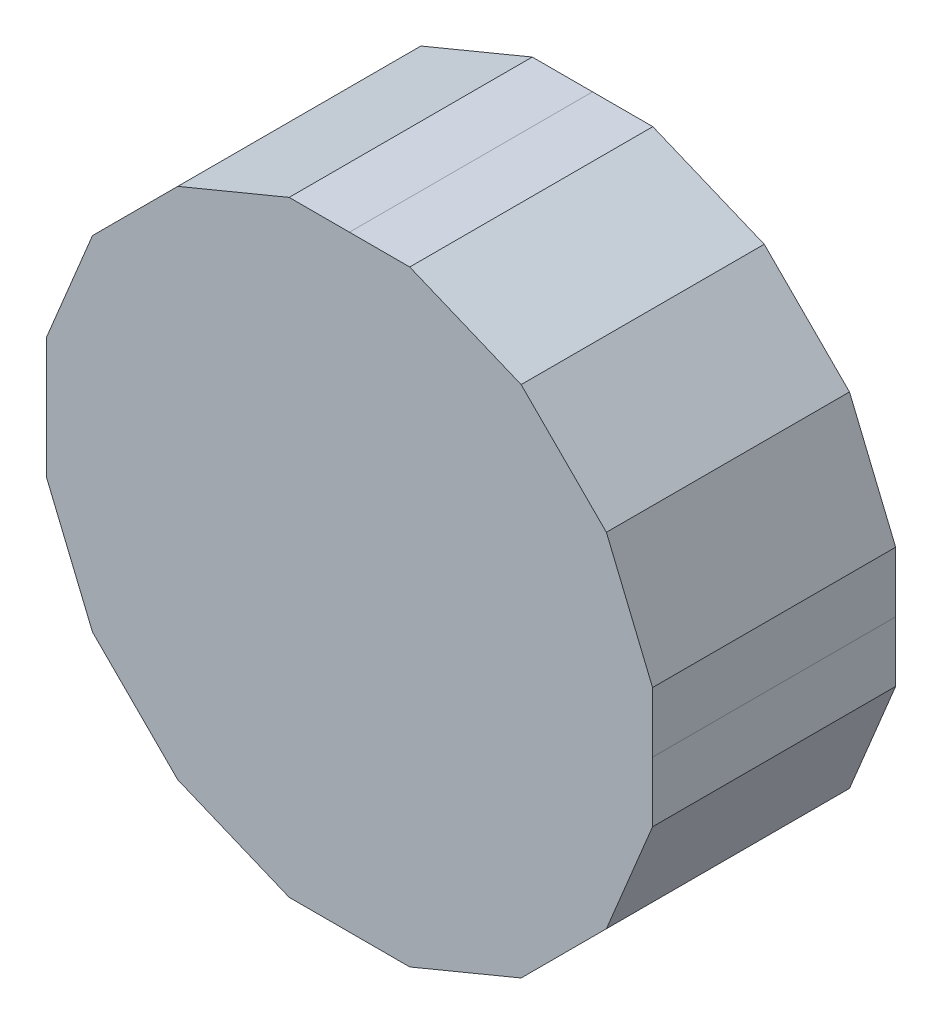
ISO-10303-21;
HEADER;
FILE_DESCRIPTION(('STEP AP214'),'2;1');
FILE_NAME('part.step','',(''),(''),'','','');
FILE_SCHEMA(('AUTOMOTIVE_DESIGN { 1 0 10303 214 1 1 1 1 }'));
ENDSEC;
DATA;
#1=APPLICATION_CONTEXT('core data for automotive mechanical design processes');
#2=APPLICATION_PROTOCOL_DEFINITION('international standard','automotive_design',2000,#1);
#3=PRODUCT_CONTEXT('',#1,'mechanical');
#4=PRODUCT('Part','Part','',(#3));
#5=PRODUCT_RELATED_PRODUCT_CATEGORY('part','',(#4));
#6=PRODUCT_DEFINITION_FORMATION('','',#4);
#7=PRODUCT_DEFINITION_CONTEXT('part definition',#1,'design');
#8=PRODUCT_DEFINITION('design','',#6,#7);
#9=PRODUCT_DEFINITION_SHAPE('','',#8);
#10=(LENGTH_UNIT() NAMED_UNIT(*) SI_UNIT(.MILLI.,.METRE.));
#11=(NAMED_UNIT(*) PLANE_ANGLE_UNIT() SI_UNIT($,.RADIAN.));
#12=(NAMED_UNIT(*) SI_UNIT($,.STERADIAN.) SOLID_ANGLE_UNIT());
#13=UNCERTAINTY_MEASURE_WITH_UNIT(LENGTH_MEASURE(1.E-05),#10,'distance_accuracy_value','');
#14=(GEOMETRIC_REPRESENTATION_CONTEXT(3) GLOBAL_UNCERTAINTY_ASSIGNED_CONTEXT((#13)) GLOBAL_UNIT_ASSIGNED_CONTEXT((#10,
#11,#12)) REPRESENTATION_CONTEXT('',''));
#15=CARTESIAN_POINT('',(0.,0.,0.));
#16=DIRECTION('',(0.,0.,1.));
#17=DIRECTION('',(1.,0.,0.));
#18=AXIS2_PLACEMENT_3D('',#15,#16,#17);
#19=CARTESIAN_POINT('',(-6.703229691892E-07,-6.703229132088E-07,0.15999968));
#20=DIRECTION('',(0.,0.,-1.));
#21=DIRECTION('',(0.,-1.,0.));
#22=AXIS2_PLACEMENT_3D('',#19,#20,#21);
#23=PLANE('',#22);
#24=DIRECTION('',(0.,1.,0.));
#25=VECTOR('',#24,1.);
#26=CARTESIAN_POINT('',(-0.1994916,-0.03968242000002,0.15999968));
#27=LINE('',#26,#25);
#28=CARTESIAN_POINT('',(-0.1994916,-0.03968242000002,0.15999968));
#29=VERTEX_POINT('',#28);
#30=CARTESIAN_POINT('',(-0.1994916,0.,0.15999968));
#31=VERTEX_POINT('',#30);
#32=EDGE_CURVE('E27',#29,#31,#27,.T.);
#33=ORIENTED_EDGE('',*,*,#32,.F.);
#34=DIRECTION('',(-0.382680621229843,0.923880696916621,0.));
#35=VECTOR('',#34,1.);
#36=CARTESIAN_POINT('',(-0.16912082,-0.1130046,0.15999968));
#37=LINE('',#36,#35);
#38=CARTESIAN_POINT('',(-0.16912082,-0.1130046,0.15999968));
#39=VERTEX_POINT('',#38);
#40=EDGE_CURVE('E197',#39,#29,#37,.T.);
#41=ORIENTED_EDGE('',*,*,#40,.F.);
#42=DIRECTION('',(-0.707106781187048,0.707106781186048,0.));
#43=VECTOR('',#42,1.);
#44=CARTESIAN_POINT('',(-0.1130046,-0.16912082,0.15999968));
#45=LINE('',#44,#43);
#46=CARTESIAN_POINT('',(-0.1130046,-0.16912082,0.15999968));
#47=VERTEX_POINT('',#46);
#48=EDGE_CURVE('E200',#47,#39,#45,.T.);
#49=ORIENTED_EDGE('',*,*,#48,.F.);
#50=DIRECTION('',(-0.923880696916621,0.382680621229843,0.));
#51=VECTOR('',#50,1.);
#52=CARTESIAN_POINT('',(-0.03968242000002,-0.1994916,0.15999968));
#53=LINE('',#52,#51);
#54=CARTESIAN_POINT('',(-0.03968242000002,-0.1994916,0.15999968));
#55=VERTEX_POINT('',#54);
#56=EDGE_CURVE('E238',#55,#47,#53,.T.);
#57=ORIENTED_EDGE('',*,*,#56,.F.);
#58=DIRECTION('',(-1.,0.,0.));
#59=VECTOR('',#58,1.);
#60=CARTESIAN_POINT('',(0.,-0.1994916,0.15999968));
#61=LINE('',#60,#59);
#62=CARTESIAN_POINT('',(0.,-0.1994916,0.15999968));
#63=VERTEX_POINT('',#62);
#64=EDGE_CURVE('E233',#63,#55,#61,.T.);
#65=ORIENTED_EDGE('',*,*,#64,.F.);
#66=DIRECTION('',(-1.,0.,0.));
#67=VECTOR('',#66,1.);
#68=CARTESIAN_POINT('',(0.03967987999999,-0.1994916,0.15999968));
#69=LINE('',#68,#67);
#70=CARTESIAN_POINT('',(0.03967987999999,-0.1994916,0.15999968));
#71=VERTEX_POINT('',#70);
#72=EDGE_CURVE('E229',#71,#63,#69,.T.);
#73=ORIENTED_EDGE('',*,*,#72,.F.);
#74=DIRECTION('',(-0.923880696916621,-0.382680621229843,0.));
#75=VECTOR('',#74,1.);
#76=CARTESIAN_POINT('',(0.11300206,-0.16912082,0.15999968));
#77=LINE('',#76,#75);
#78=CARTESIAN_POINT('',(0.11300206,-0.16912082,0.15999968));
#79=VERTEX_POINT('',#78);
#80=EDGE_CURVE('E328',#79,#71,#77,.T.);
#81=ORIENTED_EDGE('',*,*,#80,.F.);
#82=DIRECTION('',(-0.707106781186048,-0.707106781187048,0.));
#83=VECTOR('',#82,1.);
#84=CARTESIAN_POINT('',(0.16911828,-0.1130046,0.15999968));
#85=LINE('',#84,#83);
#86=CARTESIAN_POINT('',(0.16911828,-0.1130046,0.15999968));
#87=VERTEX_POINT('',#86);
#88=EDGE_CURVE('E377',#87,#79,#85,.T.);
#89=ORIENTED_EDGE('',*,*,#88,.F.);
#90=DIRECTION('',(-0.382707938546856,-0.923869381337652,0.));
#91=VECTOR('',#90,1.);
#92=CARTESIAN_POINT('',(0.1994916,-0.03968242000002,0.15999968));
#93=LINE('',#92,#91);
#94=CARTESIAN_POINT('',(0.1994916,-0.03968242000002,0.15999968));
#95=VERTEX_POINT('',#94);
#96=EDGE_CURVE('E365',#95,#87,#93,.T.);
#97=ORIENTED_EDGE('',*,*,#96,.F.);
#98=DIRECTION('',(0.,-1.,0.));
#99=VECTOR('',#98,1.);
#100=CARTESIAN_POINT('',(0.1994916,0.,0.15999968));
#101=LINE('',#100,#99);
#102=CARTESIAN_POINT('',(0.1994916,0.,0.15999968));
#103=VERTEX_POINT('',#102);
#104=EDGE_CURVE('E351',#103,#95,#101,.T.);
#105=ORIENTED_EDGE('',*,*,#104,.F.);
#106=DIRECTION('',(0.,-1.,0.));
#107=VECTOR('',#106,1.);
#108=CARTESIAN_POINT('',(0.1994916,0.03967987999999,0.15999968));
#109=LINE('',#108,#107);
#110=CARTESIAN_POINT('',(0.1994916,0.03967987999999,0.15999968));
#111=VERTEX_POINT('',#110);
#112=EDGE_CURVE('E340',#111,#103,#109,.T.);
#113=ORIENTED_EDGE('',*,*,#112,.F.);
#114=DIRECTION('',(0.382707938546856,-0.923869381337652,0.));
#115=VECTOR('',#114,1.);
#116=CARTESIAN_POINT('',(0.16911828,0.11300206,0.15999968));
#117=LINE('',#116,#115);
#118=CARTESIAN_POINT('',(0.16911828,0.11300206,0.15999968));
#119=VERTEX_POINT('',#118);
#120=EDGE_CURVE('E315',#119,#111,#117,.T.);
#121=ORIENTED_EDGE('',*,*,#120,.F.);
#122=DIRECTION('',(0.707106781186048,-0.707106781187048,0.));
#123=VECTOR('',#122,1.);
#124=CARTESIAN_POINT('',(0.11300206,0.16911828,0.15999968));
#125=LINE('',#124,#123);
#126=CARTESIAN_POINT('',(0.11300206,0.16911828,0.15999968));
#127=VERTEX_POINT('',#126);
#128=EDGE_CURVE('E317',#127,#119,#125,.T.);
#129=ORIENTED_EDGE('',*,*,#128,.F.);
#130=DIRECTION('',(0.923869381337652,-0.382707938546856,0.));
#131=VECTOR('',#130,1.);
#132=CARTESIAN_POINT('',(0.03967987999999,0.1994916,0.15999968));
#133=LINE('',#132,#131);
#134=CARTESIAN_POINT('',(0.03967987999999,0.1994916,0.15999968));
#135=VERTEX_POINT('',#134);
#136=EDGE_CURVE('E304',#135,#127,#133,.T.);
#137=ORIENTED_EDGE('',*,*,#136,.F.);
#138=DIRECTION('',(1.,0.,0.));
#139=VECTOR('',#138,1.);
#140=CARTESIAN_POINT('',(0.,0.1994916,0.15999968));
#141=LINE('',#140,#139);
#142=CARTESIAN_POINT('',(0.,0.1994916,0.15999968));
#143=VERTEX_POINT('',#142);
#144=EDGE_CURVE('E288',#143,#135,#141,.T.);
#145=ORIENTED_EDGE('',*,*,#144,.F.);
#146=DIRECTION('',(1.,0.,0.));
#147=VECTOR('',#146,1.);
#148=CARTESIAN_POINT('',(-0.03968242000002,0.1994916,0.15999968));
#149=LINE('',#148,#147);
#150=CARTESIAN_POINT('',(-0.03968242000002,0.1994916,0.15999968));
#151=VERTEX_POINT('',#150);
#152=EDGE_CURVE('E258',#151,#143,#149,.T.);
#153=ORIENTED_EDGE('',*,*,#152,.F.);
#154=DIRECTION('',(0.923869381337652,0.382707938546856,0.));
#155=VECTOR('',#154,1.);
#156=CARTESIAN_POINT('',(-0.1130046,0.16911828,0.15999968));
#157=LINE('',#156,#155);
#158=CARTESIAN_POINT('',(-0.1130046,0.16911828,0.15999968));
#159=VERTEX_POINT('',#158);
#160=EDGE_CURVE('E268',#159,#151,#157,.T.);
#161=ORIENTED_EDGE('',*,*,#160,.F.);
#162=DIRECTION('',(0.707106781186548,0.707106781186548,0.));
#163=VECTOR('',#162,1.);
#164=CARTESIAN_POINT('',(-0.16912082,0.11300206,0.15999968));
#165=LINE('',#164,#163);
#166=CARTESIAN_POINT('',(-0.16912082,0.11300206,0.15999968));
#167=VERTEX_POINT('',#166);
#168=EDGE_CURVE('E491',#167,#159,#165,.T.);
#169=ORIENTED_EDGE('',*,*,#168,.F.);
#170=DIRECTION('',(0.382680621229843,0.923880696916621,0.));
#171=VECTOR('',#170,1.);
#172=CARTESIAN_POINT('',(-0.1994916,0.03967987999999,0.15999968));
#173=LINE('',#172,#171);
#174=CARTESIAN_POINT('',(-0.1994916,0.03967987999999,0.15999968));
#175=VERTEX_POINT('',#174);
#176=EDGE_CURVE('E508',#175,#167,#173,.T.);
#177=ORIENTED_EDGE('',*,*,#176,.F.);
#178=DIRECTION('',(0.,1.,0.));
#179=VECTOR('',#178,1.);
#180=CARTESIAN_POINT('',(-0.1994916,0.,0.15999968));
#181=LINE('',#180,#179);
#182=EDGE_CURVE('E221',#31,#175,#181,.T.);
#183=ORIENTED_EDGE('',*,*,#182,.F.);
#184=EDGE_LOOP('',(#33,#41,#49,#57,#65,#73,#81,#89,#97,#105,#113,#121,#129,#137,#145,#153,#161,
#169,#177,#183));
#185=FACE_BOUND('',#184,.T.);
#186=ADVANCED_FACE('F17',(#185),#23,.F.);
#187=CARTESIAN_POINT('',(-6.703229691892E-07,-6.703229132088E-07,0.));
#188=DIRECTION('',(0.,0.,-1.));
#189=DIRECTION('',(0.,-1.,0.));
#190=AXIS2_PLACEMENT_3D('',#187,#188,#189);
#191=PLANE('',#190);
#192=DIRECTION('',(0.,1.,0.));
#193=VECTOR('',#192,1.);
#194=CARTESIAN_POINT('',(-0.1994916,0.,0.));
#195=LINE('',#194,#193);
#196=CARTESIAN_POINT('',(-0.1994916,0.,0.));
#197=VERTEX_POINT('',#196);
#198=CARTESIAN_POINT('',(-0.1994916,0.03967987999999,0.));
#199=VERTEX_POINT('',#198);
#200=EDGE_CURVE('E510',#197,#199,#195,.T.);
#201=ORIENTED_EDGE('',*,*,#200,.T.);
#202=DIRECTION('',(0.382680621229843,0.923880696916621,0.));
#203=VECTOR('',#202,1.);
#204=CARTESIAN_POINT('',(-0.1994916,0.03967987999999,0.));
#205=LINE('',#204,#203);
#206=CARTESIAN_POINT('',(-0.16912082,0.11300206,0.));
#207=VERTEX_POINT('',#206);
#208=EDGE_CURVE('E498',#199,#207,#205,.T.);
#209=ORIENTED_EDGE('',*,*,#208,.T.);
#210=DIRECTION('',(0.707106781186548,0.707106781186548,0.));
#211=VECTOR('',#210,1.);
#212=CARTESIAN_POINT('',(-0.16912082,0.11300206,0.));
#213=LINE('',#212,#211);
#214=CARTESIAN_POINT('',(-0.1130046,0.16911828,0.));
#215=VERTEX_POINT('',#214);
#216=EDGE_CURVE('E264',#207,#215,#213,.T.);
#217=ORIENTED_EDGE('',*,*,#216,.T.);
#218=DIRECTION('',(0.923869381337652,0.382707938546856,0.));
#219=VECTOR('',#218,1.);
#220=CARTESIAN_POINT('',(-0.1130046,0.16911828,0.));
#221=LINE('',#220,#219);
#222=CARTESIAN_POINT('',(-0.03968242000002,0.1994916,0.));
#223=VERTEX_POINT('',#222);
#224=EDGE_CURVE('E263',#215,#223,#221,.T.);
#225=ORIENTED_EDGE('',*,*,#224,.T.);
#226=DIRECTION('',(1.,0.,0.));
#227=VECTOR('',#226,1.);
#228=CARTESIAN_POINT('',(-0.03968242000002,0.1994916,0.));
#229=LINE('',#228,#227);
#230=CARTESIAN_POINT('',(0.,0.1994916,0.));
#231=VERTEX_POINT('',#230);
#232=EDGE_CURVE('E277',#223,#231,#229,.T.);
#233=ORIENTED_EDGE('',*,*,#232,.T.);
#234=DIRECTION('',(1.,0.,0.));
#235=VECTOR('',#234,1.);
#236=CARTESIAN_POINT('',(0.,0.1994916,0.));
#237=LINE('',#236,#235);
#238=CARTESIAN_POINT('',(0.03967987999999,0.1994916,0.));
#239=VERTEX_POINT('',#238);
#240=EDGE_CURVE('E298',#231,#239,#237,.T.);
#241=ORIENTED_EDGE('',*,*,#240,.T.);
#242=DIRECTION('',(0.923869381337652,-0.382707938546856,0.));
#243=VECTOR('',#242,1.);
#244=CARTESIAN_POINT('',(0.03967987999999,0.1994916,0.));
#245=LINE('',#244,#243);
#246=CARTESIAN_POINT('',(0.11300206,0.16911828,0.));
#247=VERTEX_POINT('',#246);
#248=EDGE_CURVE('E303',#239,#247,#245,.T.);
#249=ORIENTED_EDGE('',*,*,#248,.T.);
#250=DIRECTION('',(0.707106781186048,-0.707106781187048,0.));
#251=VECTOR('',#250,1.);
#252=CARTESIAN_POINT('',(0.11300206,0.16911828,0.));
#253=LINE('',#252,#251);
#254=CARTESIAN_POINT('',(0.16911828,0.11300206,0.));
#255=VERTEX_POINT('',#254);
#256=EDGE_CURVE('E311',#247,#255,#253,.T.);
#257=ORIENTED_EDGE('',*,*,#256,.T.);
#258=DIRECTION('',(0.382707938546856,-0.923869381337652,0.));
#259=VECTOR('',#258,1.);
#260=CARTESIAN_POINT('',(0.16911828,0.11300206,0.));
#261=LINE('',#260,#259);
#262=CARTESIAN_POINT('',(0.1994916,0.03967987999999,0.));
#263=VERTEX_POINT('',#262);
#264=EDGE_CURVE('E337',#255,#263,#261,.T.);
#265=ORIENTED_EDGE('',*,*,#264,.T.);
#266=DIRECTION('',(0.,-1.,0.));
#267=VECTOR('',#266,1.);
#268=CARTESIAN_POINT('',(0.1994916,0.03967987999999,0.));
#269=LINE('',#268,#267);
#270=CARTESIAN_POINT('',(0.1994916,0.,0.));
#271=VERTEX_POINT('',#270);
#272=EDGE_CURVE('E355',#263,#271,#269,.T.);
#273=ORIENTED_EDGE('',*,*,#272,.T.);
#274=DIRECTION('',(0.,-1.,0.));
#275=VECTOR('',#274,1.);
#276=CARTESIAN_POINT('',(0.1994916,0.,0.));
#277=LINE('',#276,#275);
#278=CARTESIAN_POINT('',(0.1994916,-0.03968242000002,0.));
#279=VERTEX_POINT('',#278);
#280=EDGE_CURVE('E350',#271,#279,#277,.T.);
#281=ORIENTED_EDGE('',*,*,#280,.T.);
#282=DIRECTION('',(-0.382707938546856,-0.923869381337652,0.));
#283=VECTOR('',#282,1.);
#284=CARTESIAN_POINT('',(0.1994916,-0.03968242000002,0.));
#285=LINE('',#284,#283);
#286=CARTESIAN_POINT('',(0.16911828,-0.1130046,0.));
#287=VERTEX_POINT('',#286);
#288=EDGE_CURVE('E373',#279,#287,#285,.T.);
#289=ORIENTED_EDGE('',*,*,#288,.T.);
#290=DIRECTION('',(-0.707106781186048,-0.707106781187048,0.));
#291=VECTOR('',#290,1.);
#292=CARTESIAN_POINT('',(0.16911828,-0.1130046,0.));
#293=LINE('',#292,#291);
#294=CARTESIAN_POINT('',(0.11300206,-0.16912082,0.));
#295=VERTEX_POINT('',#294);
#296=EDGE_CURVE('E333',#287,#295,#293,.T.);
#297=ORIENTED_EDGE('',*,*,#296,.T.);
#298=DIRECTION('',(-0.923880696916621,-0.382680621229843,0.));
#299=VECTOR('',#298,1.);
#300=CARTESIAN_POINT('',(0.11300206,-0.16912082,0.));
#301=LINE('',#300,#299);
#302=CARTESIAN_POINT('',(0.03967987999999,-0.1994916,0.));
#303=VERTEX_POINT('',#302);
#304=EDGE_CURVE('E390',#295,#303,#301,.T.);
#305=ORIENTED_EDGE('',*,*,#304,.T.);
#306=DIRECTION('',(-1.,0.,0.));
#307=VECTOR('',#306,1.);
#308=CARTESIAN_POINT('',(0.03967987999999,-0.1994916,0.));
#309=LINE('',#308,#307);
#310=CARTESIAN_POINT('',(0.,-0.1994916,0.));
#311=VERTEX_POINT('',#310);
#312=EDGE_CURVE('E237',#303,#311,#309,.T.);
#313=ORIENTED_EDGE('',*,*,#312,.T.);
#314=DIRECTION('',(-1.,0.,0.));
#315=VECTOR('',#314,1.);
#316=CARTESIAN_POINT('',(0.,-0.1994916,0.));
#317=LINE('',#316,#315);
#318=CARTESIAN_POINT('',(-0.03968242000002,-0.1994916,0.));
#319=VERTEX_POINT('',#318);
#320=EDGE_CURVE('E241',#311,#319,#317,.T.);
#321=ORIENTED_EDGE('',*,*,#320,.T.);
#322=DIRECTION('',(-0.923880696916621,0.382680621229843,0.));
#323=VECTOR('',#322,1.);
#324=CARTESIAN_POINT('',(-0.03968242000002,-0.1994916,0.));
#325=LINE('',#324,#323);
#326=CARTESIAN_POINT('',(-0.1130046,-0.16912082,0.));
#327=VERTEX_POINT('',#326);
#328=EDGE_CURVE('E192',#319,#327,#325,.T.);
#329=ORIENTED_EDGE('',*,*,#328,.T.);
#330=DIRECTION('',(-0.707106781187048,0.707106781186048,0.));
#331=VECTOR('',#330,1.);
#332=CARTESIAN_POINT('',(-0.1130046,-0.16912082,0.));
#333=LINE('',#332,#331);
#334=CARTESIAN_POINT('',(-0.16912082,-0.1130046,0.));
#335=VERTEX_POINT('',#334);
#336=EDGE_CURVE('E188',#327,#335,#333,.T.);
#337=ORIENTED_EDGE('',*,*,#336,.T.);
#338=DIRECTION('',(-0.382680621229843,0.923880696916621,0.));
#339=VECTOR('',#338,1.);
#340=CARTESIAN_POINT('',(-0.16912082,-0.1130046,0.));
#341=LINE('',#340,#339);
#342=CARTESIAN_POINT('',(-0.1994916,-0.03968242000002,0.));
#343=VERTEX_POINT('',#342);
#344=EDGE_CURVE('E20',#335,#343,#341,.T.);
#345=ORIENTED_EDGE('',*,*,#344,.T.);
#346=DIRECTION('',(0.,1.,0.));
#347=VECTOR('',#346,1.);
#348=CARTESIAN_POINT('',(-0.1994916,-0.03968242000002,0.));
#349=LINE('',#348,#347);
#350=EDGE_CURVE('E11',#343,#197,#349,.T.);
#351=ORIENTED_EDGE('',*,*,#350,.T.);
#352=EDGE_LOOP('',(#201,#209,#217,#225,#233,#241,#249,#257,#265,#273,#281,#289,#297,#305,#313,
#321,#329,#337,#345,#351));
#353=FACE_BOUND('',#352,.T.);
#354=ADVANCED_FACE('F190',(#353),#191,.T.);
#355=CARTESIAN_POINT('',(-0.1994916,-0.03968242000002,0.));
#356=DIRECTION('',(-1.,0.,0.));
#357=DIRECTION('',(0.,0.,1.));
#358=AXIS2_PLACEMENT_3D('',#355,#356,#357);
#359=PLANE('',#358);
#360=DIRECTION('',(0.,0.,1.));
#361=VECTOR('',#360,1.);
#362=CARTESIAN_POINT('',(-0.1994916,-0.03968242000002,0.));
#363=LINE('',#362,#361);
#364=EDGE_CURVE('E184',#343,#29,#363,.T.);
#365=ORIENTED_EDGE('',*,*,#364,.T.);
#366=ORIENTED_EDGE('',*,*,#32,.T.);
#367=DIRECTION('',(0.,0.,1.));
#368=VECTOR('',#367,1.);
#369=CARTESIAN_POINT('',(-0.1994916,0.,0.));
#370=LINE('',#369,#368);
#371=EDGE_CURVE('E526',#197,#31,#370,.T.);
#372=ORIENTED_EDGE('',*,*,#371,.F.);
#373=ORIENTED_EDGE('',*,*,#350,.F.);
#374=EDGE_LOOP('',(#365,#366,#372,#373));
#375=FACE_BOUND('',#374,.T.);
#376=ADVANCED_FACE('F217',(#375),#359,.T.);
#377=CARTESIAN_POINT('',(-0.16912082,-0.1130046,0.));
#378=DIRECTION('',(-0.923880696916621,-0.382680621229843,0.));
#379=DIRECTION('',(-0.382680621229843,0.923880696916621,0.));
#380=AXIS2_PLACEMENT_3D('',#377,#378,#379);
#381=PLANE('',#380);
#382=DIRECTION('',(0.,0.,1.));
#383=VECTOR('',#382,1.);
#384=CARTESIAN_POINT('',(-0.16912082,-0.1130046,0.));
#385=LINE('',#384,#383);
#386=EDGE_CURVE('E182',#335,#39,#385,.T.);
#387=ORIENTED_EDGE('',*,*,#386,.T.);
#388=ORIENTED_EDGE('',*,*,#40,.T.);
#389=ORIENTED_EDGE('',*,*,#364,.F.);
#390=ORIENTED_EDGE('',*,*,#344,.F.);
#391=EDGE_LOOP('',(#387,#388,#389,#390));
#392=FACE_BOUND('',#391,.T.);
#393=ADVANCED_FACE('F179',(#392),#381,.T.);
#394=CARTESIAN_POINT('',(-0.1130046,-0.16912082,0.));
#395=DIRECTION('',(-0.707106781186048,-0.707106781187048,0.));
#396=DIRECTION('',(-0.707106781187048,0.707106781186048,0.));
#397=AXIS2_PLACEMENT_3D('',#394,#395,#396);
#398=PLANE('',#397);
#399=DIRECTION('',(0.,0.,1.));
#400=VECTOR('',#399,1.);
#401=CARTESIAN_POINT('',(-0.1130046,-0.16912082,0.));
#402=LINE('',#401,#400);
#403=EDGE_CURVE('E209',#327,#47,#402,.T.);
#404=ORIENTED_EDGE('',*,*,#403,.T.);
#405=ORIENTED_EDGE('',*,*,#48,.T.);
#406=ORIENTED_EDGE('',*,*,#386,.F.);
#407=ORIENTED_EDGE('',*,*,#336,.F.);
#408=EDGE_LOOP('',(#404,#405,#406,#407));
#409=FACE_BOUND('',#408,.T.);
#410=ADVANCED_FACE('F199',(#409),#398,.T.);
#411=CARTESIAN_POINT('',(-0.03968242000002,-0.1994916,0.));
#412=DIRECTION('',(-0.382680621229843,-0.923880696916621,0.));
#413=DIRECTION('',(-0.923880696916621,0.382680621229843,0.));
#414=AXIS2_PLACEMENT_3D('',#411,#412,#413);
#415=PLANE('',#414);
#416=DIRECTION('',(0.,0.,1.));
#417=VECTOR('',#416,1.);
#418=CARTESIAN_POINT('',(-0.03968242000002,-0.1994916,0.));
#419=LINE('',#418,#417);
#420=EDGE_CURVE('E236',#319,#55,#419,.T.);
#421=ORIENTED_EDGE('',*,*,#420,.T.);
#422=ORIENTED_EDGE('',*,*,#56,.T.);
#423=ORIENTED_EDGE('',*,*,#403,.F.);
#424=ORIENTED_EDGE('',*,*,#328,.F.);
#425=EDGE_LOOP('',(#421,#422,#423,#424));
#426=FACE_BOUND('',#425,.T.);
#427=ADVANCED_FACE('F408',(#426),#415,.T.);
#428=CARTESIAN_POINT('',(0.,-0.1994916,0.));
#429=DIRECTION('',(0.,-1.,0.));
#430=DIRECTION('',(0.,0.,-1.));
#431=AXIS2_PLACEMENT_3D('',#428,#429,#430);
#432=PLANE('',#431);
#433=DIRECTION('',(0.,0.,1.));
#434=VECTOR('',#433,1.);
#435=CARTESIAN_POINT('',(0.,-0.1994916,0.));
#436=LINE('',#435,#434);
#437=EDGE_CURVE('E278',#311,#63,#436,.T.);
#438=ORIENTED_EDGE('',*,*,#437,.T.);
#439=ORIENTED_EDGE('',*,*,#64,.T.);
#440=ORIENTED_EDGE('',*,*,#420,.F.);
#441=ORIENTED_EDGE('',*,*,#320,.F.);
#442=EDGE_LOOP('',(#438,#439,#440,#441));
#443=FACE_BOUND('',#442,.T.);
#444=ADVANCED_FACE('F407',(#443),#432,.T.);
#445=CARTESIAN_POINT('',(0.03967987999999,-0.1994916,0.));
#446=DIRECTION('',(0.,-1.,0.));
#447=DIRECTION('',(0.,0.,-1.));
#448=AXIS2_PLACEMENT_3D('',#445,#446,#447);
#449=PLANE('',#448);
#450=DIRECTION('',(0.,0.,1.));
#451=VECTOR('',#450,1.);
#452=CARTESIAN_POINT('',(0.03967987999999,-0.1994916,0.));
#453=LINE('',#452,#451);
#454=EDGE_CURVE('E332',#303,#71,#453,.T.);
#455=ORIENTED_EDGE('',*,*,#454,.T.);
#456=ORIENTED_EDGE('',*,*,#72,.T.);
#457=ORIENTED_EDGE('',*,*,#437,.F.);
#458=ORIENTED_EDGE('',*,*,#312,.F.);
#459=EDGE_LOOP('',(#455,#456,#457,#458));
#460=FACE_BOUND('',#459,.T.);
#461=ADVANCED_FACE('F402',(#460),#449,.T.);
#462=CARTESIAN_POINT('',(0.11300206,-0.16912082,0.));
#463=DIRECTION('',(0.382680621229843,-0.923880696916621,0.));
#464=DIRECTION('',(0.,0.,-1.));
#465=AXIS2_PLACEMENT_3D('',#462,#463,#464);
#466=PLANE('',#465);
#467=DIRECTION('',(0.,0.,1.));
#468=VECTOR('',#467,1.);
#469=CARTESIAN_POINT('',(0.11300206,-0.16912082,0.));
#470=LINE('',#469,#468);
#471=EDGE_CURVE('E381',#295,#79,#470,.T.);
#472=ORIENTED_EDGE('',*,*,#471,.T.);
#473=ORIENTED_EDGE('',*,*,#80,.T.);
#474=ORIENTED_EDGE('',*,*,#454,.F.);
#475=ORIENTED_EDGE('',*,*,#304,.F.);
#476=EDGE_LOOP('',(#472,#473,#474,#475));
#477=FACE_BOUND('',#476,.T.);
#478=ADVANCED_FACE('F432',(#477),#466,.T.);
#479=CARTESIAN_POINT('',(0.16911828,-0.1130046,0.));
#480=DIRECTION('',(0.707106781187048,-0.707106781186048,0.));
#481=DIRECTION('',(0.,0.,-1.));
#482=AXIS2_PLACEMENT_3D('',#479,#480,#481);
#483=PLANE('',#482);
#484=DIRECTION('',(0.,0.,1.));
#485=VECTOR('',#484,1.);
#486=CARTESIAN_POINT('',(0.16911828,-0.1130046,0.));
#487=LINE('',#486,#485);
#488=EDGE_CURVE('E369',#287,#87,#487,.T.);
#489=ORIENTED_EDGE('',*,*,#488,.T.);
#490=ORIENTED_EDGE('',*,*,#88,.T.);
#491=ORIENTED_EDGE('',*,*,#471,.F.);
#492=ORIENTED_EDGE('',*,*,#296,.F.);
#493=EDGE_LOOP('',(#489,#490,#491,#492));
#494=FACE_BOUND('',#493,.T.);
#495=ADVANCED_FACE('F435',(#494),#483,.T.);
#496=CARTESIAN_POINT('',(0.1994916,-0.03968242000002,0.));
#497=DIRECTION('',(0.923869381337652,-0.382707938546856,0.));
#498=DIRECTION('',(0.,0.,-1.));
#499=AXIS2_PLACEMENT_3D('',#496,#497,#498);
#500=PLANE('',#499);
#501=DIRECTION('',(0.,0.,1.));
#502=VECTOR('',#501,1.);
#503=CARTESIAN_POINT('',(0.1994916,-0.03968242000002,0.));
#504=LINE('',#503,#502);
#505=EDGE_CURVE('E346',#279,#95,#504,.T.);
#506=ORIENTED_EDGE('',*,*,#505,.T.);
#507=ORIENTED_EDGE('',*,*,#96,.T.);
#508=ORIENTED_EDGE('',*,*,#488,.F.);
#509=ORIENTED_EDGE('',*,*,#288,.F.);
#510=EDGE_LOOP('',(#506,#507,#508,#509));
#511=FACE_BOUND('',#510,.T.);
#512=ADVANCED_FACE('F439',(#511),#500,.T.);
#513=CARTESIAN_POINT('',(0.1994916,0.,0.));
#514=DIRECTION('',(1.,0.,0.));
#515=DIRECTION('',(0.,1.,0.));
#516=AXIS2_PLACEMENT_3D('',#513,#514,#515);
#517=PLANE('',#516);
#518=DIRECTION('',(0.,0.,1.));
#519=VECTOR('',#518,1.);
#520=CARTESIAN_POINT('',(0.1994916,0.,0.));
#521=LINE('',#520,#519);
#522=EDGE_CURVE('E345',#271,#103,#521,.T.);
#523=ORIENTED_EDGE('',*,*,#522,.T.);
#524=ORIENTED_EDGE('',*,*,#104,.T.);
#525=ORIENTED_EDGE('',*,*,#505,.F.);
#526=ORIENTED_EDGE('',*,*,#280,.F.);
#527=EDGE_LOOP('',(#523,#524,#525,#526));
#528=FACE_BOUND('',#527,.T.);
#529=ADVANCED_FACE('F443',(#528),#517,.T.);
#530=CARTESIAN_POINT('',(0.1994916,0.03967987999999,0.));
#531=DIRECTION('',(1.,0.,0.));
#532=DIRECTION('',(0.,1.,0.));
#533=AXIS2_PLACEMENT_3D('',#530,#531,#532);
#534=PLANE('',#533);
#535=DIRECTION('',(0.,0.,1.));
#536=VECTOR('',#535,1.);
#537=CARTESIAN_POINT('',(0.1994916,0.03967987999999,0.));
#538=LINE('',#537,#536);
#539=EDGE_CURVE('E327',#263,#111,#538,.T.);
#540=ORIENTED_EDGE('',*,*,#539,.T.);
#541=ORIENTED_EDGE('',*,*,#112,.T.);
#542=ORIENTED_EDGE('',*,*,#522,.F.);
#543=ORIENTED_EDGE('',*,*,#272,.F.);
#544=EDGE_LOOP('',(#540,#541,#542,#543));
#545=FACE_BOUND('',#544,.T.);
#546=ADVANCED_FACE('F449',(#545),#534,.T.);
#547=CARTESIAN_POINT('',(0.16911828,0.11300206,0.));
#548=DIRECTION('',(0.923869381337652,0.382707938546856,0.));
#549=DIRECTION('',(0.,0.,-1.));
#550=AXIS2_PLACEMENT_3D('',#547,#548,#549);
#551=PLANE('',#550);
#552=DIRECTION('',(0.,0.,1.));
#553=VECTOR('',#552,1.);
#554=CARTESIAN_POINT('',(0.16911828,0.11300206,0.));
#555=LINE('',#554,#553);
#556=EDGE_CURVE('E316',#255,#119,#555,.T.);
#557=ORIENTED_EDGE('',*,*,#556,.T.);
#558=ORIENTED_EDGE('',*,*,#120,.T.);
#559=ORIENTED_EDGE('',*,*,#539,.F.);
#560=ORIENTED_EDGE('',*,*,#264,.F.);
#561=EDGE_LOOP('',(#557,#558,#559,#560));
#562=FACE_BOUND('',#561,.T.);
#563=ADVANCED_FACE('F446',(#562),#551,.T.);
#564=CARTESIAN_POINT('',(0.11300206,0.16911828,0.));
#565=DIRECTION('',(0.707106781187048,0.707106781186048,0.));
#566=DIRECTION('',(0.,0.,-1.));
#567=AXIS2_PLACEMENT_3D('',#564,#565,#566);
#568=PLANE('',#567);
#569=DIRECTION('',(0.,0.,1.));
#570=VECTOR('',#569,1.);
#571=CARTESIAN_POINT('',(0.11300206,0.16911828,0.));
#572=LINE('',#571,#570);
#573=EDGE_CURVE('E299',#247,#127,#572,.T.);
#574=ORIENTED_EDGE('',*,*,#573,.T.);
#575=ORIENTED_EDGE('',*,*,#128,.T.);
#576=ORIENTED_EDGE('',*,*,#556,.F.);
#577=ORIENTED_EDGE('',*,*,#256,.F.);
#578=EDGE_LOOP('',(#574,#575,#576,#577));
#579=FACE_BOUND('',#578,.T.);
#580=ADVANCED_FACE('F448',(#579),#568,.T.);
#581=CARTESIAN_POINT('',(0.03967987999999,0.1994916,0.));
#582=DIRECTION('',(0.382707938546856,0.923869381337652,0.));
#583=DIRECTION('',(0.,0.,-1.));
#584=AXIS2_PLACEMENT_3D('',#581,#582,#583);
#585=PLANE('',#584);
#586=DIRECTION('',(0.,0.,1.));
#587=VECTOR('',#586,1.);
#588=CARTESIAN_POINT('',(0.03967987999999,0.1994916,0.));
#589=LINE('',#588,#587);
#590=EDGE_CURVE('E294',#239,#135,#589,.T.);
#591=ORIENTED_EDGE('',*,*,#590,.T.);
#592=ORIENTED_EDGE('',*,*,#136,.T.);
#593=ORIENTED_EDGE('',*,*,#573,.F.);
#594=ORIENTED_EDGE('',*,*,#248,.F.);
#595=EDGE_LOOP('',(#591,#592,#593,#594));
#596=FACE_BOUND('',#595,.T.);
#597=ADVANCED_FACE('F456',(#596),#585,.T.);
#598=CARTESIAN_POINT('',(0.,0.1994916,0.));
#599=DIRECTION('',(0.,1.,0.));
#600=DIRECTION('',(1.,0.,0.));
#601=AXIS2_PLACEMENT_3D('',#598,#599,#600);
#602=PLANE('',#601);
#603=DIRECTION('',(0.,0.,1.));
#604=VECTOR('',#603,1.);
#605=CARTESIAN_POINT('',(0.,0.1994916,0.));
#606=LINE('',#605,#604);
#607=EDGE_CURVE('E262',#231,#143,#606,.T.);
#608=ORIENTED_EDGE('',*,*,#607,.T.);
#609=ORIENTED_EDGE('',*,*,#144,.T.);
#610=ORIENTED_EDGE('',*,*,#590,.F.);
#611=ORIENTED_EDGE('',*,*,#240,.F.);
#612=EDGE_LOOP('',(#608,#609,#610,#611));
#613=FACE_BOUND('',#612,.T.);
#614=ADVANCED_FACE('F470',(#613),#602,.T.);
#615=CARTESIAN_POINT('',(-0.03968242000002,0.1994916,0.));
#616=DIRECTION('',(0.,1.,0.));
#617=DIRECTION('',(1.,0.,0.));
#618=AXIS2_PLACEMENT_3D('',#615,#616,#617);
#619=PLANE('',#618);
#620=DIRECTION('',(0.,0.,1.));
#621=VECTOR('',#620,1.);
#622=CARTESIAN_POINT('',(-0.03968242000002,0.1994916,0.));
#623=LINE('',#622,#621);
#624=EDGE_CURVE('E273',#223,#151,#623,.T.);
#625=ORIENTED_EDGE('',*,*,#624,.T.);
#626=ORIENTED_EDGE('',*,*,#152,.T.);
#627=ORIENTED_EDGE('',*,*,#607,.F.);
#628=ORIENTED_EDGE('',*,*,#232,.F.);
#629=EDGE_LOOP('',(#625,#626,#627,#628));
#630=FACE_BOUND('',#629,.T.);
#631=ADVANCED_FACE('F481',(#630),#619,.T.);
#632=CARTESIAN_POINT('',(-0.1130046,0.16911828,0.));
#633=DIRECTION('',(-0.382707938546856,0.923869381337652,0.));
#634=DIRECTION('',(0.,0.,1.));
#635=AXIS2_PLACEMENT_3D('',#632,#633,#634);
#636=PLANE('',#635);
#637=DIRECTION('',(0.,0.,1.));
#638=VECTOR('',#637,1.);
#639=CARTESIAN_POINT('',(-0.1130046,0.16911828,0.));
#640=LINE('',#639,#638);
#641=EDGE_CURVE('E269',#215,#159,#640,.T.);
#642=ORIENTED_EDGE('',*,*,#641,.T.);
#643=ORIENTED_EDGE('',*,*,#160,.T.);
#644=ORIENTED_EDGE('',*,*,#624,.F.);
#645=ORIENTED_EDGE('',*,*,#224,.F.);
#646=EDGE_LOOP('',(#642,#643,#644,#645));
#647=FACE_BOUND('',#646,.T.);
#648=ADVANCED_FACE('F486',(#647),#636,.T.);
#649=CARTESIAN_POINT('',(-0.16912082,0.11300206,0.));
#650=DIRECTION('',(-0.707106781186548,0.707106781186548,0.));
#651=DIRECTION('',(0.,0.,1.));
#652=AXIS2_PLACEMENT_3D('',#649,#650,#651);
#653=PLANE('',#652);
#654=DIRECTION('',(0.,0.,1.));
#655=VECTOR('',#654,1.);
#656=CARTESIAN_POINT('',(-0.16912082,0.11300206,0.));
#657=LINE('',#656,#655);
#658=EDGE_CURVE('E257',#207,#167,#657,.T.);
#659=ORIENTED_EDGE('',*,*,#658,.T.);
#660=ORIENTED_EDGE('',*,*,#168,.T.);
#661=ORIENTED_EDGE('',*,*,#641,.F.);
#662=ORIENTED_EDGE('',*,*,#216,.F.);
#663=EDGE_LOOP('',(#659,#660,#661,#662));
#664=FACE_BOUND('',#663,.T.);
#665=ADVANCED_FACE('F494',(#664),#653,.T.);
#666=CARTESIAN_POINT('',(-0.1994916,0.03967987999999,0.));
#667=DIRECTION('',(-0.923880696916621,0.382680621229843,0.));
#668=DIRECTION('',(0.,0.,1.));
#669=AXIS2_PLACEMENT_3D('',#666,#667,#668);
#670=PLANE('',#669);
#671=DIRECTION('',(0.,0.,1.));
#672=VECTOR('',#671,1.);
#673=CARTESIAN_POINT('',(-0.1994916,0.03967987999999,0.));
#674=LINE('',#673,#672);
#675=EDGE_CURVE('E507',#199,#175,#674,.T.);
#676=ORIENTED_EDGE('',*,*,#675,.T.);
#677=ORIENTED_EDGE('',*,*,#176,.T.);
#678=ORIENTED_EDGE('',*,*,#658,.F.);
#679=ORIENTED_EDGE('',*,*,#208,.F.);
#680=EDGE_LOOP('',(#676,#677,#678,#679));
#681=FACE_BOUND('',#680,.T.);
#682=ADVANCED_FACE('F635',(#681),#670,.T.);
#683=CARTESIAN_POINT('',(-0.1994916,0.,0.));
#684=DIRECTION('',(-1.,0.,0.));
#685=DIRECTION('',(0.,0.,1.));
#686=AXIS2_PLACEMENT_3D('',#683,#684,#685);
#687=PLANE('',#686);
#688=ORIENTED_EDGE('',*,*,#371,.T.);
#689=ORIENTED_EDGE('',*,*,#182,.T.);
#690=ORIENTED_EDGE('',*,*,#675,.F.);
#691=ORIENTED_EDGE('',*,*,#200,.F.);
#692=EDGE_LOOP('',(#688,#689,#690,#691));
#693=FACE_BOUND('',#692,.T.);
#694=ADVANCED_FACE('F531',(#693),#687,.T.);
#695=CLOSED_SHELL('',(#186,#354,#376,#393,#410,#427,#444,#461,#478,#495,#512,#529,#546,#563,
#580,#597,#614,#631,#648,#665,#682,#694));
#696=MANIFOLD_SOLID_BREP('B1',#695);
#697=ADVANCED_BREP_SHAPE_REPRESENTATION('',(#18,#696),#14);
#698=SHAPE_DEFINITION_REPRESENTATION(#9,#697);
ENDSEC;
END-ISO-10303-21;
